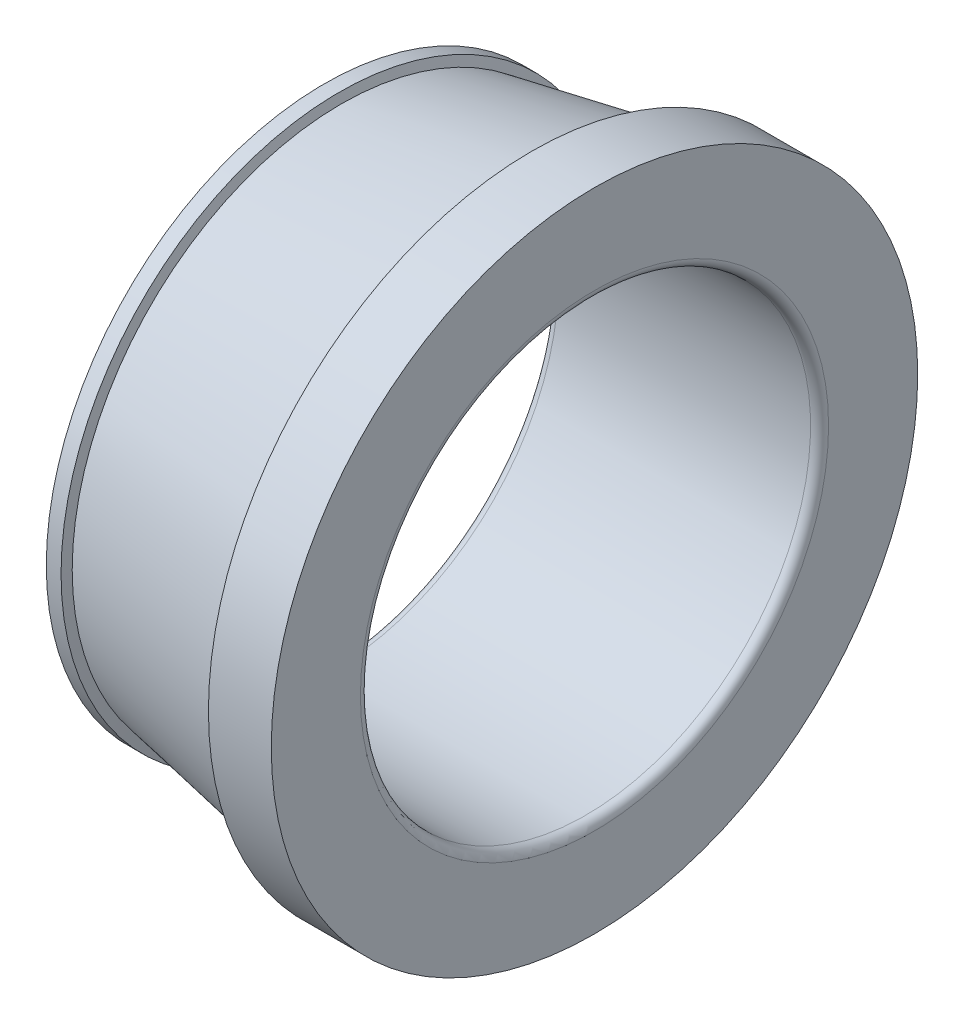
from build123d import *


with BuildPart() as part:
    # Esquisse1 → Base-R_volution (revolve)
    with BuildSketch(Plane(origin=(0, 0, 0), x_dir=(1, 0, 0), z_dir=(0, 1, 0)), mode=Mode.PRIVATE) as base_r_volution_sk:
        with BuildLine():
            Line((15.75, 12.5), (1.75, 12.5))
            ThreePointArc((1.75, 12.5), (1.396446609, 12.646446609), (1.25, 13))
            Line((1.25, 13), (1.25, 15.444759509))
            Line((1.25, 15.444759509), (2.069684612, 15.444759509))
            Line((2.069684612, 15.444759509), (2.189814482, 14.944759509))
            Line((2.189814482, 14.944759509), (13, 16.950222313))
            Line((13, 16.950222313), (12.75974026, 17.950222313))
            Line((12.75974026, 17.950222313), (16.25, 17.950222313))
            Line((16.25, 17.950222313), (16.25, 13))
            ThreePointArc((16.25, 13), (16.103553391, 12.646446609), (15.75, 12.5))
        make_face()
    revolve(base_r_volution_sk.sketch.rotate(Axis((0, 0, 0), (1, 0, 0)), 180), axis=Axis((0, 0, 0), (1, 0, 0)))


solid = part.part
